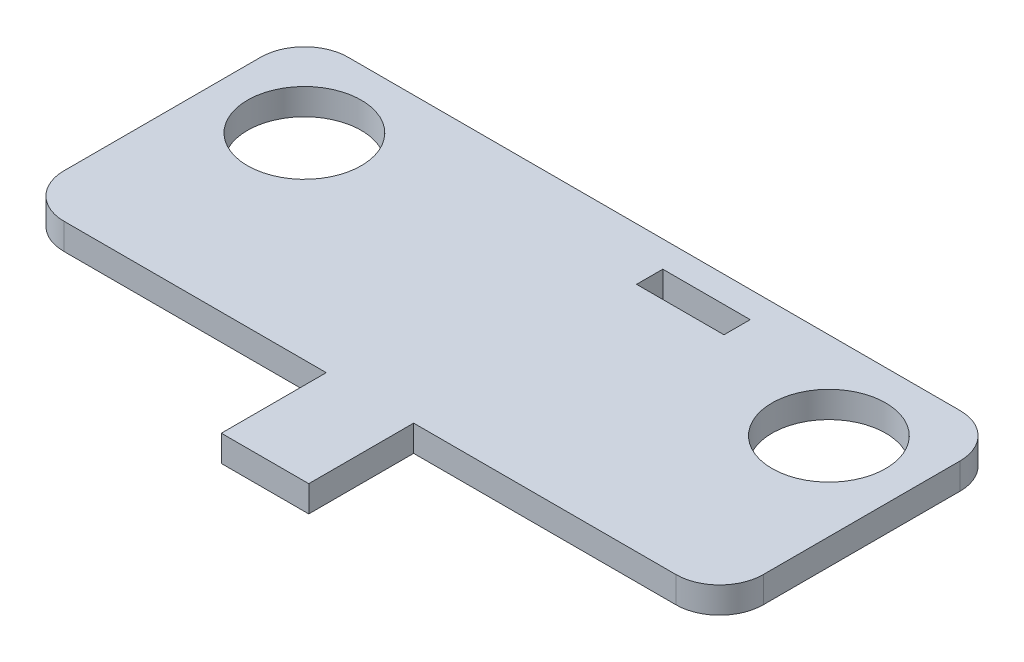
from build123d import *

# Parameters (mm, degrees)
SKETCH1_W           = 80
SKETCH1_H           = 32.5
BOSS_EXTRUDE1_DEPTH = 3
FILLET1_R           = 5
SKETCH2_R           = 6.50494922
CUT_EXTRUDE1_DEPTH  = 3
SKETCH3_W           = 10
SKETCH3_H           = 12
BOSS_EXTRUDE2_DEPTH = 3
SKETCH4_W           = 10
SKETCH4_H           = 3
CUT_EXTRUDE2_DEPTH  = 3


with BuildPart() as part:
    # Sketch1 → Boss-Extrude1 (new body)
    with BuildSketch(Plane(origin=(0, 0, 0), x_dir=(1, 0, 0), z_dir=(0, 1, 0))):
        Rectangle(SKETCH1_W, SKETCH1_H)
    extrude(amount=BOSS_EXTRUDE1_DEPTH)

    # Fillet1
    fillet1_edges = [part.edges().sort_by_distance(p)[0] for p in [
        (40, 1.5, 16.25),
        (-40, 1.5, 16.25),
        (-40, 1.5, -16.25),
        (40, 1.5, -16.25),
    ]]
    fillet(fillet1_edges, radius=FILLET1_R)

    # Sketch2 → Cut-Extrude1 (cut)
    with BuildSketch(Plane(origin=(0, 3, 0), x_dir=(1, 0, 0), z_dir=(0, 1, 0))):
        with Locations(Location((-30, 6.25, 0), (0, 0, 270))):
            Circle(SKETCH2_R)
        with Locations(Location((30, 6.25, 0), (0, 0, 270))):
            Circle(SKETCH2_R)
    extrude(amount=-CUT_EXTRUDE1_DEPTH, mode=Mode.SUBTRACT)

    # Sketch3 → Boss-Extrude2 (add)
    with BuildSketch(Plane(origin=(0, 3, 0), x_dir=(1, 0, 0), z_dir=(0, 1, 0))):
        with Locations((0, -22.25)):
            Rectangle(SKETCH3_W, SKETCH3_H)
    extrude(amount=-BOSS_EXTRUDE2_DEPTH)

    # Sketch4 → Cut-Extrude2 (cut)
    with BuildSketch(Plane(origin=(0, 3, 0), x_dir=(1, 0, 0), z_dir=(0, 1, 0))):
        with Locations((9, 11.75)):
            Rectangle(SKETCH4_W, SKETCH4_H)
    extrude(amount=-CUT_EXTRUDE2_DEPTH, mode=Mode.SUBTRACT)


solid = part.part
